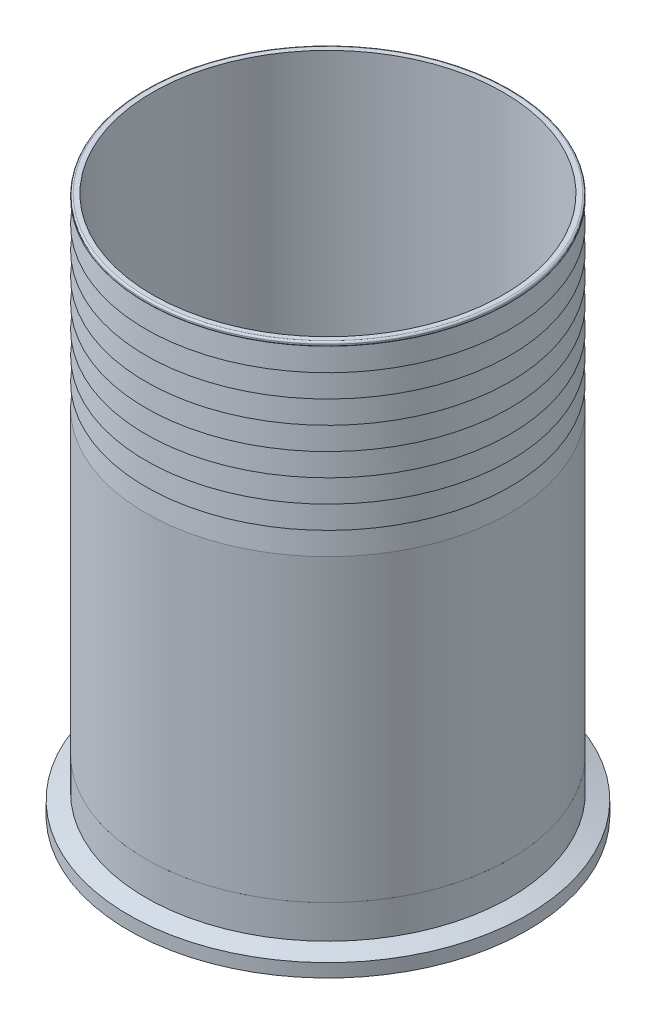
ISO-10303-21;
HEADER;
FILE_DESCRIPTION(('STEP AP214'),'2;1');
FILE_NAME('part.step','',(''),(''),'','','');
FILE_SCHEMA(('AUTOMOTIVE_DESIGN { 1 0 10303 214 1 1 1 1 }'));
ENDSEC;
DATA;
#1=APPLICATION_CONTEXT('core data for automotive mechanical design processes');
#2=APPLICATION_PROTOCOL_DEFINITION('international standard','automotive_design',2000,#1);
#3=PRODUCT_CONTEXT('',#1,'mechanical');
#4=PRODUCT('Part','Part','',(#3));
#5=PRODUCT_RELATED_PRODUCT_CATEGORY('part','',(#4));
#6=PRODUCT_DEFINITION_FORMATION('','',#4);
#7=PRODUCT_DEFINITION_CONTEXT('part definition',#1,'design');
#8=PRODUCT_DEFINITION('design','',#6,#7);
#9=PRODUCT_DEFINITION_SHAPE('','',#8);
#10=(LENGTH_UNIT() NAMED_UNIT(*) SI_UNIT(.MILLI.,.METRE.));
#11=(NAMED_UNIT(*) PLANE_ANGLE_UNIT() SI_UNIT($,.RADIAN.));
#12=(NAMED_UNIT(*) SI_UNIT($,.STERADIAN.) SOLID_ANGLE_UNIT());
#13=UNCERTAINTY_MEASURE_WITH_UNIT(LENGTH_MEASURE(1.E-05),#10,'distance_accuracy_value','');
#14=(GEOMETRIC_REPRESENTATION_CONTEXT(3) GLOBAL_UNCERTAINTY_ASSIGNED_CONTEXT((#13)) GLOBAL_UNIT_ASSIGNED_CONTEXT((#10,
#11,#12)) REPRESENTATION_CONTEXT('',''));
#15=CARTESIAN_POINT('',(0.,0.,0.));
#16=DIRECTION('',(0.,0.,1.));
#17=DIRECTION('',(1.,0.,0.));
#18=AXIS2_PLACEMENT_3D('',#15,#16,#17);
#19=CARTESIAN_POINT('',(37.7924001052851,92.9096416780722,208.508285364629));
#20=DIRECTION('',(0.,-1.,0.));
#21=DIRECTION('',(-0.363880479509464,0.,0.931445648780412));
#22=AXIS2_PLACEMENT_3D('',#19,#20,#21);
#23=PLANE('',#22);
#24=CARTESIAN_POINT('',(65.5200926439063,92.9096416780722,137.532126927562));
#25=DIRECTION('',(0.,-1.,0.));
#26=DIRECTION('',(0.931445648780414,0.,0.363880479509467));
#27=AXIS2_PLACEMENT_3D('',#24,#25,#26);
#28=CIRCLE('',#27,73.4314);
#29=CARTESIAN_POINT('',(133.91745065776,92.9096416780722,164.252379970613));
#30=VERTEX_POINT('',#29);
#31=EDGE_CURVE('P0_E85',#30,#30,#28,.T.);
#32=ORIENTED_EDGE('',*,*,#31,.F.);
#33=EDGE_LOOP('',(#32));
#34=FACE_BOUND('',#33,.T.);
#35=CARTESIAN_POINT('',(65.5200926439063,92.9096416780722,137.532126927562));
#36=DIRECTION('',(0.,-1.,0.));
#37=DIRECTION('',(-0.363880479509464,0.,0.931445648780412));
#38=AXIS2_PLACEMENT_3D('',#35,#36,#37);
#39=CIRCLE('',#38,76.2);
#40=CARTESIAN_POINT('',(37.7924001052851,92.9096416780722,208.508285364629));
#41=VERTEX_POINT('',#40);
#42=EDGE_CURVE('P0_E9',#41,#41,#39,.T.);
#43=ORIENTED_EDGE('',*,*,#42,.T.);
#44=EDGE_LOOP('',(#43));
#45=FACE_BOUND('',#44,.T.);
#46=ADVANCED_FACE('P0_F14',(#34,#45),#23,.T.);
#47=CARTESIAN_POINT('',(65.5200926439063,92.9096416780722,137.532126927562));
#48=DIRECTION('',(0.,-1.,0.));
#49=DIRECTION('',(-0.363880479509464,0.,0.931445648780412));
#50=AXIS2_PLACEMENT_3D('',#47,#48,#49);
#51=CYLINDRICAL_SURFACE('',#50,76.2);
#52=CARTESIAN_POINT('',(65.5200926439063,218.334841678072,137.532126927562));
#53=DIRECTION('',(0.,-1.,0.));
#54=DIRECTION('',(-0.363880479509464,0.,0.931445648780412));
#55=AXIS2_PLACEMENT_3D('',#52,#53,#54);
#56=CIRCLE('',#55,76.2);
#57=CARTESIAN_POINT('',(37.7924001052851,218.334841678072,208.508285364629));
#58=VERTEX_POINT('',#57);
#59=EDGE_CURVE('P0_E20',#58,#58,#56,.T.);
#60=ORIENTED_EDGE('',*,*,#59,.T.);
#61=EDGE_LOOP('',(#60));
#62=FACE_BOUND('',#61,.T.);
#63=ORIENTED_EDGE('',*,*,#42,.F.);
#64=EDGE_LOOP('',(#63));
#65=FACE_BOUND('',#64,.T.);
#66=ADVANCED_FACE('P0_F101',(#62,#65),#51,.T.);
#67=CARTESIAN_POINT('',(65.5200926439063,218.334841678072,137.532126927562));
#68=DIRECTION('',(0.,-1.,0.));
#69=DIRECTION('',(-0.363880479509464,0.,0.931445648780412));
#70=AXIS2_PLACEMENT_3D('',#67,#68,#69);
#71=CONICAL_SURFACE('',#70,76.2,0.0835411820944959);
#72=CARTESIAN_POINT('',(65.5200926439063,227.73819627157,137.532126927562));
#73=DIRECTION('',(0.,-1.,0.));
#74=DIRECTION('',(-0.363880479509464,0.,0.931445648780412));
#75=AXIS2_PLACEMENT_3D('',#72,#73,#74);
#76=CIRCLE('',#75,75.4126);
#77=CARTESIAN_POINT('',(38.0789195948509,227.73819627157,207.77486506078));
#78=VERTEX_POINT('',#77);
#79=EDGE_CURVE('P0_E24',#78,#78,#76,.T.);
#80=ORIENTED_EDGE('',*,*,#79,.T.);
#81=EDGE_LOOP('',(#80));
#82=FACE_BOUND('',#81,.T.);
#83=ORIENTED_EDGE('',*,*,#59,.F.);
#84=EDGE_LOOP('',(#83));
#85=FACE_BOUND('',#84,.T.);
#86=ADVANCED_FACE('P0_F106',(#82,#85),#71,.T.);
#87=CARTESIAN_POINT('',(65.5200926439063,227.73819627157,137.532126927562));
#88=DIRECTION('',(0.,1.,0.));
#89=DIRECTION('',(0.363880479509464,0.,-0.931445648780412));
#90=AXIS2_PLACEMENT_3D('',#87,#88,#89);
#91=CONICAL_SURFACE('',#90,75.4126,1.41751812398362);
#92=CARTESIAN_POINT('',(65.5200926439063,227.859841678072,137.532126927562));
#93=DIRECTION('',(0.,-1.,0.));
#94=DIRECTION('',(-0.363880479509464,0.,0.931445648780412));
#95=AXIS2_PLACEMENT_3D('',#92,#93,#94);
#96=CIRCLE('',#95,76.2);
#97=CARTESIAN_POINT('',(37.7924001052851,227.859841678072,208.508285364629));
#98=VERTEX_POINT('',#97);
#99=EDGE_CURVE('P0_E28',#98,#98,#96,.T.);
#100=ORIENTED_EDGE('',*,*,#99,.T.);
#101=EDGE_LOOP('',(#100));
#102=FACE_BOUND('',#101,.T.);
#103=ORIENTED_EDGE('',*,*,#79,.F.);
#104=EDGE_LOOP('',(#103));
#105=FACE_BOUND('',#104,.T.);
#106=ADVANCED_FACE('P0_F110',(#102,#105),#91,.T.);
#107=CARTESIAN_POINT('',(65.5200926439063,227.859841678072,137.532126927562));
#108=DIRECTION('',(0.,-1.,0.));
#109=DIRECTION('',(-0.363880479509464,0.,0.931445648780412));
#110=AXIS2_PLACEMENT_3D('',#107,#108,#109);
#111=CONICAL_SURFACE('',#110,76.2,0.0835411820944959);
#112=CARTESIAN_POINT('',(65.5200926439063,237.26319627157,137.532126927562));
#113=DIRECTION('',(0.,-1.,0.));
#114=DIRECTION('',(-0.363880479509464,0.,0.931445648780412));
#115=AXIS2_PLACEMENT_3D('',#112,#113,#114);
#116=CIRCLE('',#115,75.4126);
#117=CARTESIAN_POINT('',(38.0789195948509,237.26319627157,207.77486506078));
#118=VERTEX_POINT('',#117);
#119=EDGE_CURVE('P0_E33',#118,#118,#116,.T.);
#120=ORIENTED_EDGE('',*,*,#119,.T.);
#121=EDGE_LOOP('',(#120));
#122=FACE_BOUND('',#121,.T.);
#123=ORIENTED_EDGE('',*,*,#99,.F.);
#124=EDGE_LOOP('',(#123));
#125=FACE_BOUND('',#124,.T.);
#126=ADVANCED_FACE('P0_F117',(#122,#125),#111,.T.);
#127=CARTESIAN_POINT('',(65.5200926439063,237.26319627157,137.532126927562));
#128=DIRECTION('',(0.,1.,0.));
#129=DIRECTION('',(0.363880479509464,0.,-0.931445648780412));
#130=AXIS2_PLACEMENT_3D('',#127,#128,#129);
#131=CONICAL_SURFACE('',#130,75.4126,1.41751812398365);
#132=CARTESIAN_POINT('',(65.5200926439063,237.384841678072,137.532126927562));
#133=DIRECTION('',(0.,-1.,0.));
#134=DIRECTION('',(-0.363880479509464,0.,0.931445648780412));
#135=AXIS2_PLACEMENT_3D('',#132,#133,#134);
#136=CIRCLE('',#135,76.2);
#137=CARTESIAN_POINT('',(37.7924001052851,237.384841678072,208.508285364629));
#138=VERTEX_POINT('',#137);
#139=EDGE_CURVE('P0_E36',#138,#138,#136,.T.);
#140=ORIENTED_EDGE('',*,*,#139,.T.);
#141=EDGE_LOOP('',(#140));
#142=FACE_BOUND('',#141,.T.);
#143=ORIENTED_EDGE('',*,*,#119,.F.);
#144=EDGE_LOOP('',(#143));
#145=FACE_BOUND('',#144,.T.);
#146=ADVANCED_FACE('P0_F121',(#142,#145),#131,.T.);
#147=CARTESIAN_POINT('',(65.5200926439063,237.384841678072,137.532126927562));
#148=DIRECTION('',(0.,-1.,0.));
#149=DIRECTION('',(-0.363880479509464,0.,0.931445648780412));
#150=AXIS2_PLACEMENT_3D('',#147,#148,#149);
#151=CONICAL_SURFACE('',#150,76.2,0.0835411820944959);
#152=CARTESIAN_POINT('',(65.5200926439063,246.78819627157,137.532126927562));
#153=DIRECTION('',(0.,-1.,0.));
#154=DIRECTION('',(-0.363880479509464,0.,0.931445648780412));
#155=AXIS2_PLACEMENT_3D('',#152,#153,#154);
#156=CIRCLE('',#155,75.4126);
#157=CARTESIAN_POINT('',(38.0789195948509,246.78819627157,207.77486506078));
#158=VERTEX_POINT('',#157);
#159=EDGE_CURVE('P0_E39',#158,#158,#156,.T.);
#160=ORIENTED_EDGE('',*,*,#159,.T.);
#161=EDGE_LOOP('',(#160));
#162=FACE_BOUND('',#161,.T.);
#163=ORIENTED_EDGE('',*,*,#139,.F.);
#164=EDGE_LOOP('',(#163));
#165=FACE_BOUND('',#164,.T.);
#166=ADVANCED_FACE('P0_F125',(#162,#165),#151,.T.);
#167=CARTESIAN_POINT('',(65.5200926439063,246.78819627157,137.532126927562));
#168=DIRECTION('',(0.,1.,0.));
#169=DIRECTION('',(0.363880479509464,0.,-0.931445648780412));
#170=AXIS2_PLACEMENT_3D('',#167,#168,#169);
#171=CONICAL_SURFACE('',#170,75.4126,1.41751812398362);
#172=CARTESIAN_POINT('',(65.5200926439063,246.909841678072,137.532126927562));
#173=DIRECTION('',(0.,-1.,0.));
#174=DIRECTION('',(-0.363880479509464,0.,0.931445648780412));
#175=AXIS2_PLACEMENT_3D('',#172,#173,#174);
#176=CIRCLE('',#175,76.2);
#177=CARTESIAN_POINT('',(37.7924001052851,246.909841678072,208.508285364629));
#178=VERTEX_POINT('',#177);
#179=EDGE_CURVE('P0_E42',#178,#178,#176,.T.);
#180=ORIENTED_EDGE('',*,*,#179,.T.);
#181=EDGE_LOOP('',(#180));
#182=FACE_BOUND('',#181,.T.);
#183=ORIENTED_EDGE('',*,*,#159,.F.);
#184=EDGE_LOOP('',(#183));
#185=FACE_BOUND('',#184,.T.);
#186=ADVANCED_FACE('P0_F129',(#182,#185),#171,.T.);
#187=CARTESIAN_POINT('',(65.5200926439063,246.909841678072,137.532126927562));
#188=DIRECTION('',(0.,-1.,0.));
#189=DIRECTION('',(-0.363880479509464,0.,0.931445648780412));
#190=AXIS2_PLACEMENT_3D('',#187,#188,#189);
#191=CONICAL_SURFACE('',#190,76.2,0.0835411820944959);
#192=CARTESIAN_POINT('',(65.5200926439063,256.31319627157,137.532126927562));
#193=DIRECTION('',(0.,-1.,0.));
#194=DIRECTION('',(-0.363880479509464,0.,0.931445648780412));
#195=AXIS2_PLACEMENT_3D('',#192,#193,#194);
#196=CIRCLE('',#195,75.4126);
#197=CARTESIAN_POINT('',(38.0789195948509,256.31319627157,207.77486506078));
#198=VERTEX_POINT('',#197);
#199=EDGE_CURVE('P0_E45',#198,#198,#196,.T.);
#200=ORIENTED_EDGE('',*,*,#199,.T.);
#201=EDGE_LOOP('',(#200));
#202=FACE_BOUND('',#201,.T.);
#203=ORIENTED_EDGE('',*,*,#179,.F.);
#204=EDGE_LOOP('',(#203));
#205=FACE_BOUND('',#204,.T.);
#206=ADVANCED_FACE('P0_F133',(#202,#205),#191,.T.);
#207=CARTESIAN_POINT('',(65.5200926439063,256.31319627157,137.532126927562));
#208=DIRECTION('',(0.,1.,0.));
#209=DIRECTION('',(0.363880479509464,0.,-0.931445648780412));
#210=AXIS2_PLACEMENT_3D('',#207,#208,#209);
#211=CONICAL_SURFACE('',#210,75.4126,1.41751812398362);
#212=CARTESIAN_POINT('',(65.5200926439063,256.434841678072,137.532126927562));
#213=DIRECTION('',(0.,-1.,0.));
#214=DIRECTION('',(-0.363880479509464,0.,0.931445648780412));
#215=AXIS2_PLACEMENT_3D('',#212,#213,#214);
#216=CIRCLE('',#215,76.2);
#217=CARTESIAN_POINT('',(37.7924001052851,256.434841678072,208.508285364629));
#218=VERTEX_POINT('',#217);
#219=EDGE_CURVE('P0_E48',#218,#218,#216,.T.);
#220=ORIENTED_EDGE('',*,*,#219,.T.);
#221=EDGE_LOOP('',(#220));
#222=FACE_BOUND('',#221,.T.);
#223=ORIENTED_EDGE('',*,*,#199,.F.);
#224=EDGE_LOOP('',(#223));
#225=FACE_BOUND('',#224,.T.);
#226=ADVANCED_FACE('P0_F137',(#222,#225),#211,.T.);
#227=CARTESIAN_POINT('',(65.5200926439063,256.434841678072,137.532126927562));
#228=DIRECTION('',(0.,-1.,0.));
#229=DIRECTION('',(-0.363880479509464,0.,0.931445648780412));
#230=AXIS2_PLACEMENT_3D('',#227,#228,#229);
#231=CONICAL_SURFACE('',#230,76.2,0.0835411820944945);
#232=CARTESIAN_POINT('',(65.5200926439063,265.83819627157,137.532126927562));
#233=DIRECTION('',(0.,-1.,0.));
#234=DIRECTION('',(-0.363880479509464,0.,0.931445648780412));
#235=AXIS2_PLACEMENT_3D('',#232,#233,#234);
#236=CIRCLE('',#235,75.4126);
#237=CARTESIAN_POINT('',(38.0789195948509,265.83819627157,207.77486506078));
#238=VERTEX_POINT('',#237);
#239=EDGE_CURVE('P0_E51',#238,#238,#236,.T.);
#240=ORIENTED_EDGE('',*,*,#239,.T.);
#241=EDGE_LOOP('',(#240));
#242=FACE_BOUND('',#241,.T.);
#243=ORIENTED_EDGE('',*,*,#219,.F.);
#244=EDGE_LOOP('',(#243));
#245=FACE_BOUND('',#244,.T.);
#246=ADVANCED_FACE('P0_F141',(#242,#245),#231,.T.);
#247=CARTESIAN_POINT('',(65.5200926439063,265.83819627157,137.532126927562));
#248=DIRECTION('',(0.,1.,0.));
#249=DIRECTION('',(0.363880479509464,0.,-0.931445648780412));
#250=AXIS2_PLACEMENT_3D('',#247,#248,#249);
#251=CONICAL_SURFACE('',#250,75.4126,1.41751812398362);
#252=CARTESIAN_POINT('',(65.5200926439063,265.959841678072,137.532126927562));
#253=DIRECTION('',(0.,-1.,0.));
#254=DIRECTION('',(-0.363880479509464,0.,0.931445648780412));
#255=AXIS2_PLACEMENT_3D('',#252,#253,#254);
#256=CIRCLE('',#255,76.2);
#257=CARTESIAN_POINT('',(37.7924001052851,265.959841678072,208.508285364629));
#258=VERTEX_POINT('',#257);
#259=EDGE_CURVE('P0_E54',#258,#258,#256,.T.);
#260=ORIENTED_EDGE('',*,*,#259,.T.);
#261=EDGE_LOOP('',(#260));
#262=FACE_BOUND('',#261,.T.);
#263=ORIENTED_EDGE('',*,*,#239,.F.);
#264=EDGE_LOOP('',(#263));
#265=FACE_BOUND('',#264,.T.);
#266=ADVANCED_FACE('P0_F145',(#262,#265),#251,.T.);
#267=CARTESIAN_POINT('',(65.5200926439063,265.959841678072,137.532126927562));
#268=DIRECTION('',(0.,-1.,0.));
#269=DIRECTION('',(-0.363880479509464,0.,0.931445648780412));
#270=AXIS2_PLACEMENT_3D('',#267,#268,#269);
#271=CONICAL_SURFACE('',#270,76.2,0.0835411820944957);
#272=CARTESIAN_POINT('',(65.5200926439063,275.36319627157,137.532126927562));
#273=DIRECTION('',(0.,-1.,0.));
#274=DIRECTION('',(-0.363880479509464,0.,0.931445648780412));
#275=AXIS2_PLACEMENT_3D('',#272,#273,#274);
#276=CIRCLE('',#275,75.4126);
#277=CARTESIAN_POINT('',(38.0789195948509,275.36319627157,207.77486506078));
#278=VERTEX_POINT('',#277);
#279=EDGE_CURVE('P0_E57',#278,#278,#276,.T.);
#280=ORIENTED_EDGE('',*,*,#279,.T.);
#281=EDGE_LOOP('',(#280));
#282=FACE_BOUND('',#281,.T.);
#283=ORIENTED_EDGE('',*,*,#259,.F.);
#284=EDGE_LOOP('',(#283));
#285=FACE_BOUND('',#284,.T.);
#286=ADVANCED_FACE('P0_F149',(#282,#285),#271,.T.);
#287=CARTESIAN_POINT('',(65.5200926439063,275.36319627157,137.532126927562));
#288=DIRECTION('',(0.,1.,0.));
#289=DIRECTION('',(0.363880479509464,0.,-0.931445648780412));
#290=AXIS2_PLACEMENT_3D('',#287,#288,#289);
#291=CONICAL_SURFACE('',#290,75.4126,1.41751812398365);
#292=CARTESIAN_POINT('',(65.5200926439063,275.484841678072,137.532126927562));
#293=DIRECTION('',(0.,-1.,0.));
#294=DIRECTION('',(-0.363880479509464,0.,0.931445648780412));
#295=AXIS2_PLACEMENT_3D('',#292,#293,#294);
#296=CIRCLE('',#295,76.2);
#297=CARTESIAN_POINT('',(37.7924001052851,275.484841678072,208.508285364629));
#298=VERTEX_POINT('',#297);
#299=EDGE_CURVE('P0_E60',#298,#298,#296,.T.);
#300=ORIENTED_EDGE('',*,*,#299,.T.);
#301=EDGE_LOOP('',(#300));
#302=FACE_BOUND('',#301,.T.);
#303=ORIENTED_EDGE('',*,*,#279,.F.);
#304=EDGE_LOOP('',(#303));
#305=FACE_BOUND('',#304,.T.);
#306=ADVANCED_FACE('P0_F153',(#302,#305),#291,.T.);
#307=CARTESIAN_POINT('',(65.5200926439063,275.484841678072,137.532126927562));
#308=DIRECTION('',(0.,-1.,0.));
#309=DIRECTION('',(-0.363880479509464,0.,0.931445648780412));
#310=AXIS2_PLACEMENT_3D('',#307,#308,#309);
#311=CONICAL_SURFACE('',#310,76.2,0.0835411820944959);
#312=CARTESIAN_POINT('',(65.5200926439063,284.88819627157,137.532126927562));
#313=DIRECTION('',(0.,-1.,0.));
#314=DIRECTION('',(-0.363880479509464,0.,0.931445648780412));
#315=AXIS2_PLACEMENT_3D('',#312,#313,#314);
#316=CIRCLE('',#315,75.4126);
#317=CARTESIAN_POINT('',(38.0789195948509,284.88819627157,207.77486506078));
#318=VERTEX_POINT('',#317);
#319=EDGE_CURVE('P0_E63',#318,#318,#316,.T.);
#320=ORIENTED_EDGE('',*,*,#319,.T.);
#321=EDGE_LOOP('',(#320));
#322=FACE_BOUND('',#321,.T.);
#323=ORIENTED_EDGE('',*,*,#299,.F.);
#324=EDGE_LOOP('',(#323));
#325=FACE_BOUND('',#324,.T.);
#326=ADVANCED_FACE('P0_F157',(#322,#325),#311,.T.);
#327=CARTESIAN_POINT('',(65.5200926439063,284.88819627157,137.532126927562));
#328=DIRECTION('',(0.,1.,0.));
#329=DIRECTION('',(0.363880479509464,0.,-0.931445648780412));
#330=AXIS2_PLACEMENT_3D('',#327,#328,#329);
#331=CONICAL_SURFACE('',#330,75.4126,1.41751812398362);
#332=CARTESIAN_POINT('',(65.5200926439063,285.009841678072,137.532126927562));
#333=DIRECTION('',(0.,-1.,0.));
#334=DIRECTION('',(-0.363880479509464,0.,0.931445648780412));
#335=AXIS2_PLACEMENT_3D('',#332,#333,#334);
#336=CIRCLE('',#335,76.2);
#337=CARTESIAN_POINT('',(37.7924001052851,285.009841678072,208.508285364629));
#338=VERTEX_POINT('',#337);
#339=EDGE_CURVE('P0_E66',#338,#338,#336,.T.);
#340=ORIENTED_EDGE('',*,*,#339,.T.);
#341=EDGE_LOOP('',(#340));
#342=FACE_BOUND('',#341,.T.);
#343=ORIENTED_EDGE('',*,*,#319,.F.);
#344=EDGE_LOOP('',(#343));
#345=FACE_BOUND('',#344,.T.);
#346=ADVANCED_FACE('P0_F161',(#342,#345),#331,.T.);
#347=CARTESIAN_POINT('',(65.5200926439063,285.009841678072,137.532126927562));
#348=DIRECTION('',(0.,-1.,0.));
#349=DIRECTION('',(-0.363880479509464,0.,0.931445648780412));
#350=AXIS2_PLACEMENT_3D('',#347,#348,#349);
#351=CONICAL_SURFACE('',#350,76.2,0.0835411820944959);
#352=CARTESIAN_POINT('',(65.5200926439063,294.41319627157,137.532126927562));
#353=DIRECTION('',(0.,-1.,0.));
#354=DIRECTION('',(-0.363880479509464,0.,0.931445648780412));
#355=AXIS2_PLACEMENT_3D('',#352,#353,#354);
#356=CIRCLE('',#355,75.4126);
#357=CARTESIAN_POINT('',(38.0789195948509,294.41319627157,207.77486506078));
#358=VERTEX_POINT('',#357);
#359=EDGE_CURVE('P0_E69',#358,#358,#356,.T.);
#360=ORIENTED_EDGE('',*,*,#359,.T.);
#361=EDGE_LOOP('',(#360));
#362=FACE_BOUND('',#361,.T.);
#363=ORIENTED_EDGE('',*,*,#339,.F.);
#364=EDGE_LOOP('',(#363));
#365=FACE_BOUND('',#364,.T.);
#366=ADVANCED_FACE('P0_F165',(#362,#365),#351,.T.);
#367=CARTESIAN_POINT('',(65.5200926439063,294.41319627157,137.532126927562));
#368=DIRECTION('',(0.,1.,0.));
#369=DIRECTION('',(0.363880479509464,0.,-0.931445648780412));
#370=AXIS2_PLACEMENT_3D('',#367,#368,#369);
#371=CONICAL_SURFACE('',#370,75.4126,1.41751812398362);
#372=CARTESIAN_POINT('',(65.5200926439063,294.501592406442,137.532126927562));
#373=DIRECTION('',(0.,-1.,0.));
#374=DIRECTION('',(-0.363880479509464,0.,0.931445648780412));
#375=AXIS2_PLACEMENT_3D('',#372,#373,#374);
#376=CIRCLE('',#375,75.9847803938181);
#377=CARTESIAN_POINT('',(37.8707143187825,294.501592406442,208.307819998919));
#378=VERTEX_POINT('',#377);
#379=EDGE_CURVE('P0_E72',#378,#378,#376,.T.);
#380=ORIENTED_EDGE('',*,*,#379,.T.);
#381=EDGE_LOOP('',(#380));
#382=FACE_BOUND('',#381,.T.);
#383=ORIENTED_EDGE('',*,*,#359,.F.);
#384=EDGE_LOOP('',(#383));
#385=FACE_BOUND('',#384,.T.);
#386=ADVANCED_FACE('P0_F169',(#382,#385),#371,.T.);
#387=CARTESIAN_POINT('',(65.5200926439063,294.752614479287,137.532126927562));
#388=DIRECTION('',(0.,-1.,0.));
#389=DIRECTION('',(-0.363880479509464,0.,0.931445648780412));
#390=AXIS2_PLACEMENT_3D('',#387,#388,#389);
#391=TOROIDAL_SURFACE('',#390,75.946,0.254000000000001);
#392=CARTESIAN_POINT('',(65.5200926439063,294.752614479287,137.532126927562));
#393=DIRECTION('',(0.,-1.,0.));
#394=DIRECTION('',(-0.363880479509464,0.,0.931445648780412));
#395=AXIS2_PLACEMENT_3D('',#392,#393,#394);
#396=CIRCLE('',#395,76.2);
#397=CARTESIAN_POINT('',(37.7924001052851,294.752614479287,208.508285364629));
#398=VERTEX_POINT('',#397);
#399=EDGE_CURVE('P0_E75',#398,#398,#396,.T.);
#400=ORIENTED_EDGE('',*,*,#399,.T.);
#401=EDGE_LOOP('',(#400));
#402=FACE_BOUND('',#401,.T.);
#403=ORIENTED_EDGE('',*,*,#379,.F.);
#404=EDGE_LOOP('',(#403));
#405=FACE_BOUND('',#404,.T.);
#406=ADVANCED_FACE('P0_F173',(#402,#405),#391,.T.);
#407=CARTESIAN_POINT('',(65.5200926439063,92.9096416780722,137.532126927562));
#408=DIRECTION('',(0.,-1.,0.));
#409=DIRECTION('',(-0.363880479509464,0.,0.931445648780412));
#410=AXIS2_PLACEMENT_3D('',#407,#408,#409);
#411=CYLINDRICAL_SURFACE('',#410,76.2);
#412=CARTESIAN_POINT('',(65.5200926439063,295.347641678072,137.532126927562));
#413=DIRECTION('',(0.,-1.,0.));
#414=DIRECTION('',(-0.363880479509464,0.,0.931445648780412));
#415=AXIS2_PLACEMENT_3D('',#412,#413,#414);
#416=CIRCLE('',#415,76.2);
#417=CARTESIAN_POINT('',(37.7924001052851,295.347641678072,208.508285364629));
#418=VERTEX_POINT('',#417);
#419=EDGE_CURVE('P0_E78',#418,#418,#416,.T.);
#420=ORIENTED_EDGE('',*,*,#419,.T.);
#421=EDGE_LOOP('',(#420));
#422=FACE_BOUND('',#421,.T.);
#423=ORIENTED_EDGE('',*,*,#399,.F.);
#424=EDGE_LOOP('',(#423));
#425=FACE_BOUND('',#424,.T.);
#426=ADVANCED_FACE('P0_F177',(#422,#425),#411,.T.);
#427=CARTESIAN_POINT('',(65.5200926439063,295.347641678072,137.532126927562));
#428=DIRECTION('',(0.,-1.,0.));
#429=DIRECTION('',(-0.363880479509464,0.,0.931445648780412));
#430=AXIS2_PLACEMENT_3D('',#427,#428,#429);
#431=TOROIDAL_SURFACE('',#430,75.438,0.76200000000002);
#432=CARTESIAN_POINT('',(65.5200926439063,296.109641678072,137.532126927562));
#433=DIRECTION('',(0.,-1.,0.));
#434=DIRECTION('',(-0.363880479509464,0.,0.931445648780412));
#435=AXIS2_PLACEMENT_3D('',#432,#433,#434);
#436=CIRCLE('',#435,75.4379999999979);
#437=CARTESIAN_POINT('',(38.0696770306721,296.109641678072,207.798523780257));
#438=VERTEX_POINT('',#437);
#439=EDGE_CURVE('P0_E81',#438,#438,#436,.T.);
#440=ORIENTED_EDGE('',*,*,#439,.T.);
#441=EDGE_LOOP('',(#440));
#442=FACE_BOUND('',#441,.T.);
#443=ORIENTED_EDGE('',*,*,#419,.F.);
#444=EDGE_LOOP('',(#443));
#445=FACE_BOUND('',#444,.T.);
#446=ADVANCED_FACE('P0_F181',(#442,#445),#431,.T.);
#447=CARTESIAN_POINT('',(65.5200926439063,296.109641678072,137.532126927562));
#448=DIRECTION('',(0.,1.,0.));
#449=DIRECTION('',(0.363880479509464,0.,-0.931445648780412));
#450=AXIS2_PLACEMENT_3D('',#447,#448,#449);
#451=PLANE('',#450);
#452=CARTESIAN_POINT('',(65.5200926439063,296.109641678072,137.532126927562));
#453=DIRECTION('',(0.,-1.,0.));
#454=DIRECTION('',(0.931445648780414,0.,0.363880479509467));
#455=AXIS2_PLACEMENT_3D('',#452,#453,#454);
#456=CIRCLE('',#455,73.4314);
#457=CARTESIAN_POINT('',(133.91745065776,296.109641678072,164.252379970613));
#458=VERTEX_POINT('',#457);
#459=EDGE_CURVE('P0_E84',#458,#458,#456,.T.);
#460=ORIENTED_EDGE('',*,*,#459,.T.);
#461=EDGE_LOOP('',(#460));
#462=FACE_BOUND('',#461,.T.);
#463=ORIENTED_EDGE('',*,*,#439,.F.);
#464=EDGE_LOOP('',(#463));
#465=FACE_BOUND('',#464,.T.);
#466=ADVANCED_FACE('P0_F91',(#462,#465),#451,.T.);
#467=CARTESIAN_POINT('',(65.5200926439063,296.109641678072,137.532126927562));
#468=DIRECTION('',(0.,-1.,0.));
#469=DIRECTION('',(0.931445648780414,0.,0.363880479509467));
#470=AXIS2_PLACEMENT_3D('',#467,#468,#469);
#471=CYLINDRICAL_SURFACE('',#470,73.4314);
#472=ORIENTED_EDGE('',*,*,#459,.F.);
#473=EDGE_LOOP('',(#472));
#474=FACE_BOUND('',#473,.T.);
#475=ORIENTED_EDGE('',*,*,#31,.T.);
#476=EDGE_LOOP('',(#475));
#477=FACE_BOUND('',#476,.T.);
#478=ADVANCED_FACE('P0_F94',(#474,#477),#471,.F.);
#479=CLOSED_SHELL('',(#46,#66,#86,#106,#126,#146,#166,#186,#206,#226,#246,#266,#286,#306,#326,
#346,#366,#386,#406,#426,#446,#466,#478));
#480=MANIFOLD_SOLID_BREP('P0_B1',#479);
#481=CARTESIAN_POINT('',(65.5200926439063,71.4720416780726,137.532126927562));
#482=DIRECTION('',(0.,-0.999999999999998,0.));
#483=DIRECTION('',(0.,0.,-0.999999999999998));
#484=AXIS2_PLACEMENT_3D('',#481,#482,#483);
#485=TOROIDAL_SURFACE('',#484,79.9992084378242,0.787400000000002);
#486=CARTESIAN_POINT('',(65.5200926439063,70.6846416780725,137.532126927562));
#487=DIRECTION('',(0.,-0.999999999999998,0.));
#488=DIRECTION('',(0.,0.,-0.999999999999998));
#489=AXIS2_PLACEMENT_3D('',#486,#487,#488);
#490=CIRCLE('',#489,79.9992084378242);
#491=CARTESIAN_POINT('',(65.5200926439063,70.6846416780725,57.5329184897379));
#492=VERTEX_POINT('',#491);
#493=EDGE_CURVE('P1_E49',#492,#492,#490,.T.);
#494=ORIENTED_EDGE('',*,*,#493,.T.);
#495=EDGE_LOOP('',(#494));
#496=FACE_BOUND('',#495,.T.);
#497=CARTESIAN_POINT('',(65.5200926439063,71.1591006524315,137.532126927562));
#498=DIRECTION('',(0.,-0.999999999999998,0.));
#499=DIRECTION('',(0.,0.,-0.999999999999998));
#500=AXIS2_PLACEMENT_3D('',#497,#498,#499);
#501=CIRCLE('',#500,79.2766666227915);
#502=CARTESIAN_POINT('',(65.5200926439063,71.1591006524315,58.2554603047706));
#503=VERTEX_POINT('',#502);
#504=EDGE_CURVE('P1_E10',#503,#503,#501,.T.);
#505=ORIENTED_EDGE('',*,*,#504,.F.);
#506=EDGE_LOOP('',(#505));
#507=FACE_BOUND('',#506,.T.);
#508=ADVANCED_FACE('P1_F15',(#496,#507),#485,.T.);
#509=CARTESIAN_POINT('',(65.5200926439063,70.6846416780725,137.532126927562));
#510=DIRECTION('',(0.,-0.999999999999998,0.));
#511=DIRECTION('',(0.,0.,-0.999999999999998));
#512=AXIS2_PLACEMENT_3D('',#509,#510,#511);
#513=TOROIDAL_SURFACE('',#512,78.1812,1.1938);
#514=CARTESIAN_POINT('',(65.5200926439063,71.1591006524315,137.532126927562));
#515=DIRECTION('',(0.,-0.999999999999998,0.));
#516=DIRECTION('',(0.,0.,-0.999999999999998));
#517=AXIS2_PLACEMENT_3D('',#514,#515,#516);
#518=CIRCLE('',#517,77.0857333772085);
#519=CARTESIAN_POINT('',(65.5200926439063,71.1591006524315,60.4463935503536));
#520=VERTEX_POINT('',#519);
#521=EDGE_CURVE('P1_E21',#520,#520,#518,.T.);
#522=ORIENTED_EDGE('',*,*,#521,.F.);
#523=EDGE_LOOP('',(#522));
#524=FACE_BOUND('',#523,.T.);
#525=ORIENTED_EDGE('',*,*,#504,.T.);
#526=EDGE_LOOP('',(#525));
#527=FACE_BOUND('',#526,.T.);
#528=ADVANCED_FACE('P1_F98',(#524,#527),#513,.F.);
#529=CARTESIAN_POINT('',(65.5200926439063,71.4720416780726,137.532126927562));
#530=DIRECTION('',(0.,-0.999999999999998,0.));
#531=DIRECTION('',(0.,0.,-0.999999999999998));
#532=AXIS2_PLACEMENT_3D('',#529,#530,#531);
#533=TOROIDAL_SURFACE('',#532,76.3631915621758,0.787399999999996);
#534=ORIENTED_EDGE('',*,*,#521,.T.);
#535=EDGE_LOOP('',(#534));
#536=FACE_BOUND('',#535,.T.);
#537=CARTESIAN_POINT('',(65.5200926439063,70.6846416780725,137.532126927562));
#538=DIRECTION('',(0.,-0.999999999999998,0.));
#539=DIRECTION('',(0.,0.,-0.999999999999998));
#540=AXIS2_PLACEMENT_3D('',#537,#538,#539);
#541=CIRCLE('',#540,76.3631915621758);
#542=CARTESIAN_POINT('',(65.5200926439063,70.6846416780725,61.1689353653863));
#543=VERTEX_POINT('',#542);
#544=EDGE_CURVE('P1_E25',#543,#543,#541,.T.);
#545=ORIENTED_EDGE('',*,*,#544,.F.);
#546=EDGE_LOOP('',(#545));
#547=FACE_BOUND('',#546,.T.);
#548=ADVANCED_FACE('P1_F94',(#536,#547),#533,.T.);
#549=CARTESIAN_POINT('',(65.5200926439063,70.6846416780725,137.532126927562));
#550=DIRECTION('',(0.,0.999999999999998,0.));
#551=DIRECTION('',(0.,0.,0.999999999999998));
#552=AXIS2_PLACEMENT_3D('',#549,#550,#551);
#553=PLANE('',#552);
#554=CARTESIAN_POINT('',(65.5200926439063,70.6846416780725,137.532126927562));
#555=DIRECTION('',(0.,-0.999999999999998,0.));
#556=DIRECTION('',(0.,0.,-0.999999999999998));
#557=AXIS2_PLACEMENT_3D('',#554,#555,#556);
#558=CIRCLE('',#557,73.4314);
#559=CARTESIAN_POINT('',(65.5200926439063,70.6846416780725,64.1007269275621));
#560=VERTEX_POINT('',#559);
#561=EDGE_CURVE('P1_E29',#560,#560,#558,.T.);
#562=ORIENTED_EDGE('',*,*,#561,.F.);
#563=EDGE_LOOP('',(#562));
#564=FACE_BOUND('',#563,.T.);
#565=ORIENTED_EDGE('',*,*,#544,.T.);
#566=EDGE_LOOP('',(#565));
#567=FACE_BOUND('',#566,.T.);
#568=ADVANCED_FACE('P1_F87',(#564,#567),#553,.F.);
#569=CARTESIAN_POINT('',(65.5200926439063,70.6846416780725,137.532126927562));
#570=DIRECTION('',(0.,-0.999999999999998,0.));
#571=DIRECTION('',(0.,0.,-0.999999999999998));
#572=AXIS2_PLACEMENT_3D('',#569,#570,#571);
#573=CYLINDRICAL_SURFACE('',#572,73.4314);
#574=CARTESIAN_POINT('',(65.5200926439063,92.9096416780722,137.532126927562));
#575=DIRECTION('',(0.,-0.999999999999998,0.));
#576=DIRECTION('',(0.,0.,-0.999999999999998));
#577=AXIS2_PLACEMENT_3D('',#574,#575,#576);
#578=CIRCLE('',#577,73.4314);
#579=CARTESIAN_POINT('',(65.5200926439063,92.9096416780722,64.1007269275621));
#580=VERTEX_POINT('',#579);
#581=EDGE_CURVE('P1_E34',#580,#580,#578,.T.);
#582=CARTESIAN_POINT('',(65.5200926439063,70.6846416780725,64.1007269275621));
#583=CARTESIAN_POINT('',(65.5200926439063,70.9161520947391,64.1007269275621));
#584=CARTESIAN_POINT('',(65.5200926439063,71.1476625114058,64.1007269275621));
#585=CARTESIAN_POINT('',(65.5200926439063,71.6106833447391,64.1007269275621));
#586=CARTESIAN_POINT('',(65.5200926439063,71.8421937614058,64.1007269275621));
#587=CARTESIAN_POINT('',(65.5200926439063,72.3052145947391,64.1007269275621));
#588=CARTESIAN_POINT('',(65.5200926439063,72.5367250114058,64.1007269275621));
#589=CARTESIAN_POINT('',(65.5200926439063,72.9997458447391,64.1007269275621));
#590=CARTESIAN_POINT('',(65.5200926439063,73.2312562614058,64.1007269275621));
#591=CARTESIAN_POINT('',(65.5200926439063,73.6942770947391,64.1007269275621));
#592=CARTESIAN_POINT('',(65.5200926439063,73.9257875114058,64.1007269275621));
#593=CARTESIAN_POINT('',(65.5200926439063,74.3888083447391,64.1007269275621));
#594=CARTESIAN_POINT('',(65.5200926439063,74.6203187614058,64.1007269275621));
#595=CARTESIAN_POINT('',(65.5200926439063,75.0833395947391,64.1007269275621));
#596=CARTESIAN_POINT('',(65.5200926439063,75.3148500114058,64.1007269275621));
#597=CARTESIAN_POINT('',(65.5200926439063,75.7778708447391,64.1007269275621));
#598=CARTESIAN_POINT('',(65.5200926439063,76.0093812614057,64.1007269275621));
#599=CARTESIAN_POINT('',(65.5200926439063,76.4724020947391,64.1007269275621));
#600=CARTESIAN_POINT('',(65.5200926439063,76.7039125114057,64.1007269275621));
#601=CARTESIAN_POINT('',(65.5200926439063,77.1669333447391,64.1007269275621));
#602=CARTESIAN_POINT('',(65.5200926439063,77.3984437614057,64.1007269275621));
#603=CARTESIAN_POINT('',(65.5200926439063,77.8614645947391,64.1007269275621));
#604=CARTESIAN_POINT('',(65.5200926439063,78.0929750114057,64.1007269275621));
#605=CARTESIAN_POINT('',(65.5200926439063,78.555995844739,64.1007269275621));
#606=CARTESIAN_POINT('',(65.5200926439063,78.7875062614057,64.1007269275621));
#607=CARTESIAN_POINT('',(65.5200926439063,79.250527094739,64.1007269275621));
#608=CARTESIAN_POINT('',(65.5200926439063,79.4820375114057,64.1007269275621));
#609=CARTESIAN_POINT('',(65.5200926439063,79.945058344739,64.1007269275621));
#610=CARTESIAN_POINT('',(65.5200926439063,80.1765687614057,64.1007269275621));
#611=CARTESIAN_POINT('',(65.5200926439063,80.639589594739,64.1007269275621));
#612=CARTESIAN_POINT('',(65.5200926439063,80.8711000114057,64.1007269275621));
#613=CARTESIAN_POINT('',(65.5200926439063,81.334120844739,64.1007269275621));
#614=CARTESIAN_POINT('',(65.5200926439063,81.5656312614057,64.1007269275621));
#615=CARTESIAN_POINT('',(65.5200926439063,82.028652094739,64.1007269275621));
#616=CARTESIAN_POINT('',(65.5200926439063,82.2601625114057,64.1007269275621));
#617=CARTESIAN_POINT('',(65.5200926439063,82.723183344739,64.1007269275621));
#618=CARTESIAN_POINT('',(65.5200926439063,82.9546937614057,64.1007269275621));
#619=CARTESIAN_POINT('',(65.5200926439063,83.417714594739,64.1007269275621));
#620=CARTESIAN_POINT('',(65.5200926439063,83.6492250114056,64.1007269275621));
#621=CARTESIAN_POINT('',(65.5200926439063,84.112245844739,64.1007269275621));
#622=CARTESIAN_POINT('',(65.5200926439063,84.3437562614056,64.1007269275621));
#623=CARTESIAN_POINT('',(65.5200926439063,84.806777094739,64.1007269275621));
#624=CARTESIAN_POINT('',(65.5200926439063,85.0382875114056,64.1007269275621));
#625=CARTESIAN_POINT('',(65.5200926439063,85.501308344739,64.1007269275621));
#626=CARTESIAN_POINT('',(65.5200926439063,85.7328187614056,64.1007269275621));
#627=CARTESIAN_POINT('',(65.5200926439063,86.1958395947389,64.1007269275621));
#628=CARTESIAN_POINT('',(65.5200926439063,86.4273500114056,64.1007269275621));
#629=CARTESIAN_POINT('',(65.5200926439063,86.8903708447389,64.1007269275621));
#630=CARTESIAN_POINT('',(65.5200926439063,87.1218812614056,64.1007269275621));
#631=CARTESIAN_POINT('',(65.5200926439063,87.5849020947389,64.1007269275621));
#632=CARTESIAN_POINT('',(65.5200926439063,87.8164125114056,64.1007269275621));
#633=CARTESIAN_POINT('',(65.5200926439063,88.2794333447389,64.1007269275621));
#634=CARTESIAN_POINT('',(65.5200926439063,88.5109437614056,64.1007269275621));
#635=CARTESIAN_POINT('',(65.5200926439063,88.9739645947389,64.1007269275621));
#636=CARTESIAN_POINT('',(65.5200926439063,89.2054750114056,64.1007269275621));
#637=CARTESIAN_POINT('',(65.5200926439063,89.6684958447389,64.1007269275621));
#638=CARTESIAN_POINT('',(65.5200926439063,89.9000062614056,64.1007269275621));
#639=CARTESIAN_POINT('',(65.5200926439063,90.3630270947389,64.1007269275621));
#640=CARTESIAN_POINT('',(65.5200926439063,90.5945375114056,64.1007269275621));
#641=CARTESIAN_POINT('',(65.5200926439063,91.0575583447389,64.1007269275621));
#642=CARTESIAN_POINT('',(65.5200926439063,91.2890687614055,64.1007269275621));
#643=CARTESIAN_POINT('',(65.5200926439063,91.7520895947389,64.1007269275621));
#644=CARTESIAN_POINT('',(65.5200926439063,91.9836000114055,64.1007269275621));
#645=CARTESIAN_POINT('',(65.5200926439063,92.4466208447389,64.1007269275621));
#646=CARTESIAN_POINT('',(65.5200926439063,92.6781312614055,64.1007269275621));
#647=CARTESIAN_POINT('',(65.5200926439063,92.9096416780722,64.1007269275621));
#648=B_SPLINE_CURVE_WITH_KNOTS('',3,(#582,#583,#584,#585,#586,#587,#588,#589,#590,#591,#592,
#593,#594,#595,#596,#597,#598,#599,#600,#601,#602,#603,#604,#605,#606,#607,#608,#609,#610,#611,
#612,#613,#614,#615,#616,#617,#618,#619,#620,#621,#622,#623,#624,#625,#626,#627,#628,#629,#630,
#631,#632,#633,#634,#635,#636,#637,#638,#639,#640,#641,#642,#643,#644,#645,#646,#647),
.UNSPECIFIED.,.F.,.F.,(4,2,2,2,2,2,2,2,2,2,2,2,2,2,2,2,2,2,2,2,2,2,2,2,2,2,2,2,2,2,2,2,4),(0.,
0.694531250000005,1.3890625,2.08359374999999,2.77812499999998,3.47265624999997,4.16718749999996,
4.86171874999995,5.55624999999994,6.25078124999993,6.94531249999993,7.63984374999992,
8.33437499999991,9.0289062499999,9.72343749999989,10.4179687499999,11.1124999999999,
11.8070312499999,12.5015624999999,13.1960937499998,13.8906249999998,14.5851562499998,
15.2796874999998,15.9742187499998,16.6687499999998,17.3632812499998,18.0578124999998,
18.7523437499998,19.4468749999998,20.1414062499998,20.8359374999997,21.5304687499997,
22.2249999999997),.UNSPECIFIED.);
#649=EDGE_CURVE('P1_BSEAM82',#560,#580,#648,.T.);
#650=ORIENTED_EDGE('',*,*,#561,.T.);
#651=ORIENTED_EDGE('',*,*,#581,.F.);
#652=ORIENTED_EDGE('',*,*,#649,.T.);
#653=ORIENTED_EDGE('',*,*,#649,.F.);
#654=EDGE_LOOP('',(#650,#652,#651,#653));
#655=FACE_BOUND('',#654,.T.);
#656=ADVANCED_FACE('P1_F82',(#655),#573,.F.);
#657=CARTESIAN_POINT('',(65.5200926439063,92.9096416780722,137.532126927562));
#658=DIRECTION('',(0.,-0.999999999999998,0.));
#659=DIRECTION('',(0.,0.,-0.999999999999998));
#660=AXIS2_PLACEMENT_3D('',#657,#658,#659);
#661=PLANE('',#660);
#662=CARTESIAN_POINT('',(65.5200926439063,92.9096416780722,137.532126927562));
#663=DIRECTION('',(0.,-0.999999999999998,0.));
#664=DIRECTION('',(0.,0.,-0.999999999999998));
#665=AXIS2_PLACEMENT_3D('',#662,#663,#664);
#666=CIRCLE('',#665,76.2);
#667=CARTESIAN_POINT('',(65.5200926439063,92.9096416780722,61.3321269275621));
#668=VERTEX_POINT('',#667);
#669=EDGE_CURVE('P1_E37',#668,#668,#666,.T.);
#670=ORIENTED_EDGE('',*,*,#669,.F.);
#671=EDGE_LOOP('',(#670));
#672=FACE_BOUND('',#671,.T.);
#673=ORIENTED_EDGE('',*,*,#581,.T.);
#674=EDGE_LOOP('',(#673));
#675=FACE_BOUND('',#674,.T.);
#676=ADVANCED_FACE('P1_F76',(#672,#675),#661,.F.);
#677=CARTESIAN_POINT('',(65.5200926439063,70.6846416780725,137.532126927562));
#678=DIRECTION('',(0.,-0.999999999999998,0.));
#679=DIRECTION('',(0.,0.,-0.999999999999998));
#680=AXIS2_PLACEMENT_3D('',#677,#678,#679);
#681=CYLINDRICAL_SURFACE('',#680,76.2);
#682=CARTESIAN_POINT('',(65.5200926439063,78.9074222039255,137.532126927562));
#683=DIRECTION('',(0.,-0.999999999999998,0.));
#684=DIRECTION('',(0.,0.,-0.999999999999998));
#685=AXIS2_PLACEMENT_3D('',#682,#683,#684);
#686=CIRCLE('',#685,76.2);
#687=CARTESIAN_POINT('',(65.5200926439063,78.9074222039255,61.3321269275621));
#688=VERTEX_POINT('',#687);
#689=EDGE_CURVE('P1_E40',#688,#688,#686,.T.);
#690=CARTESIAN_POINT('',(65.5200926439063,78.9074222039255,61.3321269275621));
#691=CARTESIAN_POINT('',(65.5200926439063,79.0532786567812,61.3321269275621));
#692=CARTESIAN_POINT('',(65.5200926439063,79.1991351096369,61.3321269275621));
#693=CARTESIAN_POINT('',(65.5200926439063,79.4908480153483,61.3321269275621));
#694=CARTESIAN_POINT('',(65.5200926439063,79.6367044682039,61.3321269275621));
#695=CARTESIAN_POINT('',(65.5200926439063,79.9284173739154,61.3321269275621));
#696=CARTESIAN_POINT('',(65.5200926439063,80.074273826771,61.3321269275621));
#697=CARTESIAN_POINT('',(65.5200926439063,80.3659867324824,61.3321269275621));
#698=CARTESIAN_POINT('',(65.5200926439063,80.5118431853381,61.3321269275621));
#699=CARTESIAN_POINT('',(65.5200926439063,80.8035560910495,61.3321269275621));
#700=CARTESIAN_POINT('',(65.5200926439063,80.9494125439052,61.3321269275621));
#701=CARTESIAN_POINT('',(65.5200926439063,81.2411254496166,61.3321269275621));
#702=CARTESIAN_POINT('',(65.5200926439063,81.3869819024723,61.3321269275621));
#703=CARTESIAN_POINT('',(65.5200926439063,81.6786948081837,61.3321269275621));
#704=CARTESIAN_POINT('',(65.5200926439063,81.8245512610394,61.3321269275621));
#705=CARTESIAN_POINT('',(65.5200926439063,82.1162641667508,61.3321269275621));
#706=CARTESIAN_POINT('',(65.5200926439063,82.2621206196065,61.3321269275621));
#707=CARTESIAN_POINT('',(65.5200926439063,82.5538335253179,61.3321269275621));
#708=CARTESIAN_POINT('',(65.5200926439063,82.6996899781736,61.3321269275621));
#709=CARTESIAN_POINT('',(65.5200926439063,82.9914028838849,61.3321269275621));
#710=CARTESIAN_POINT('',(65.5200926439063,83.1372593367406,61.3321269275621));
#711=CARTESIAN_POINT('',(65.5200926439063,83.428972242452,61.3321269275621));
#712=CARTESIAN_POINT('',(65.5200926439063,83.5748286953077,61.3321269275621));
#713=CARTESIAN_POINT('',(65.5200926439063,83.8665416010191,61.3321269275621));
#714=CARTESIAN_POINT('',(65.5200926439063,84.0123980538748,61.3321269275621));
#715=CARTESIAN_POINT('',(65.5200926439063,84.3041109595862,61.3321269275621));
#716=CARTESIAN_POINT('',(65.5200926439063,84.4499674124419,61.3321269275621));
#717=CARTESIAN_POINT('',(65.5200926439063,84.7416803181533,61.3321269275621));
#718=CARTESIAN_POINT('',(65.5200926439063,84.887536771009,61.3321269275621));
#719=CARTESIAN_POINT('',(65.5200926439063,85.1792496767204,61.3321269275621));
#720=CARTESIAN_POINT('',(65.5200926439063,85.3251061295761,61.3321269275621));
#721=CARTESIAN_POINT('',(65.5200926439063,85.6168190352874,61.3321269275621));
#722=CARTESIAN_POINT('',(65.5200926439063,85.7626754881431,61.3321269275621));
#723=CARTESIAN_POINT('',(65.5200926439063,86.0543883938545,61.3321269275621));
#724=CARTESIAN_POINT('',(65.5200926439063,86.2002448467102,61.3321269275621));
#725=CARTESIAN_POINT('',(65.5200926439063,86.4919577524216,61.3321269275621));
#726=CARTESIAN_POINT('',(65.5200926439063,86.6378142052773,61.3321269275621));
#727=CARTESIAN_POINT('',(65.5200926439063,86.9295271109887,61.3321269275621));
#728=CARTESIAN_POINT('',(65.5200926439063,87.0753835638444,61.3321269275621));
#729=CARTESIAN_POINT('',(65.5200926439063,87.3670964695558,61.3321269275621));
#730=CARTESIAN_POINT('',(65.5200926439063,87.5129529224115,61.3321269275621));
#731=CARTESIAN_POINT('',(65.5200926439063,87.8046658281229,61.3321269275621));
#732=CARTESIAN_POINT('',(65.5200926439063,87.9505222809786,61.3321269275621));
#733=CARTESIAN_POINT('',(65.5200926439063,88.24223518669,61.3321269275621));
#734=CARTESIAN_POINT('',(65.5200926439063,88.3880916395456,61.3321269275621));
#735=CARTESIAN_POINT('',(65.5200926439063,88.679804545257,61.3321269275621));
#736=CARTESIAN_POINT('',(65.5200926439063,88.8256609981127,61.3321269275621));
#737=CARTESIAN_POINT('',(65.5200926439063,89.1173739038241,61.3321269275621));
#738=CARTESIAN_POINT('',(65.5200926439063,89.2632303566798,61.3321269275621));
#739=CARTESIAN_POINT('',(65.5200926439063,89.5549432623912,61.3321269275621));
#740=CARTESIAN_POINT('',(65.5200926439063,89.7007997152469,61.3321269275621));
#741=CARTESIAN_POINT('',(65.5200926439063,89.9925126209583,61.3321269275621));
#742=CARTESIAN_POINT('',(65.5200926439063,90.138369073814,61.3321269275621));
#743=CARTESIAN_POINT('',(65.5200926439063,90.4300819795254,61.3321269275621));
#744=CARTESIAN_POINT('',(65.5200926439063,90.5759384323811,61.3321269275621));
#745=CARTESIAN_POINT('',(65.5200926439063,90.8676513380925,61.3321269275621));
#746=CARTESIAN_POINT('',(65.5200926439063,91.0135077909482,61.3321269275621));
#747=CARTESIAN_POINT('',(65.5200926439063,91.3052206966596,61.3321269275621));
#748=CARTESIAN_POINT('',(65.5200926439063,91.4510771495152,61.3321269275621));
#749=CARTESIAN_POINT('',(65.5200926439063,91.7427900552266,61.3321269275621));
#750=CARTESIAN_POINT('',(65.5200926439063,91.8886465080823,61.3321269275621));
#751=CARTESIAN_POINT('',(65.5200926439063,92.1803594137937,61.3321269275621));
#752=CARTESIAN_POINT('',(65.5200926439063,92.3262158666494,61.3321269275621));
#753=CARTESIAN_POINT('',(65.5200926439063,92.6179287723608,61.3321269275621));
#754=CARTESIAN_POINT('',(65.5200926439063,92.7637852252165,61.3321269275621));
#755=CARTESIAN_POINT('',(65.5200926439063,92.9096416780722,61.3321269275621));
#756=B_SPLINE_CURVE_WITH_KNOTS('',3,(#690,#691,#692,#693,#694,#695,#696,#697,#698,#699,#700,
#701,#702,#703,#704,#705,#706,#707,#708,#709,#710,#711,#712,#713,#714,#715,#716,#717,#718,#719,
#720,#721,#722,#723,#724,#725,#726,#727,#728,#729,#730,#731,#732,#733,#734,#735,#736,#737,#738,
#739,#740,#741,#742,#743,#744,#745,#746,#747,#748,#749,#750,#751,#752,#753,#754,#755),
.UNSPECIFIED.,.F.,.F.,(4,2,2,2,2,2,2,2,2,2,2,2,2,2,2,2,2,2,2,2,2,2,2,2,2,2,2,2,2,2,2,2,4),(0.,
0.437569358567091,0.875138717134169,1.31270807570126,1.75027743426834,2.18784679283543,
2.62541615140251,3.0629855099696,3.50055486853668,3.93812422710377,4.37569358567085,
4.81326294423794,5.25083230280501,5.68840166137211,6.12597101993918,6.56354037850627,
7.00110973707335,7.43867909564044,7.87624845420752,8.31381781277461,8.7513871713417,
9.18895652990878,9.62652588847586,10.064095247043,10.50166460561,10.9392339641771,
11.3768033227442,11.8143726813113,12.2519420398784,12.6895113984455,13.1270807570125,
13.5646501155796,14.0022194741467),.UNSPECIFIED.);
#757=EDGE_CURVE('P1_BSEAM70',#688,#668,#756,.T.);
#758=ORIENTED_EDGE('',*,*,#689,.F.);
#759=ORIENTED_EDGE('',*,*,#669,.T.);
#760=ORIENTED_EDGE('',*,*,#757,.T.);
#761=ORIENTED_EDGE('',*,*,#757,.F.);
#762=EDGE_LOOP('',(#758,#760,#759,#761));
#763=FACE_BOUND('',#762,.T.);
#764=ADVANCED_FACE('P1_F70',(#763),#681,.T.);
#765=CARTESIAN_POINT('',(65.5200926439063,78.9074222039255,137.532126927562));
#766=DIRECTION('',(0.,-0.999999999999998,0.));
#767=DIRECTION('',(0.,0.,-0.999999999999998));
#768=AXIS2_PLACEMENT_3D('',#765,#766,#767);
#769=CONICAL_SURFACE('',#768,76.2,1.22173047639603);
#770=CARTESIAN_POINT('',(65.5200926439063,76.2726416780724,137.532126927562));
#771=DIRECTION('',(0.,-0.999999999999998,0.));
#772=DIRECTION('',(0.,0.,-0.999999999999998));
#773=AXIS2_PLACEMENT_3D('',#770,#771,#772);
#774=CIRCLE('',#773,83.439);
#775=CARTESIAN_POINT('',(65.5200926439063,76.2726416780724,54.0931269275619));
#776=VERTEX_POINT('',#775);
#777=EDGE_CURVE('P1_E43',#776,#776,#774,.T.);
#778=CARTESIAN_POINT('',(65.5200926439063,76.2726416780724,54.0931269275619));
#779=CARTESIAN_POINT('',(65.5200926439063,76.30008730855,54.1685331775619));
#780=CARTESIAN_POINT('',(65.5200926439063,76.3275329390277,54.2439394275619));
#781=CARTESIAN_POINT('',(65.5200926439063,76.3824241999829,54.3947519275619));
#782=CARTESIAN_POINT('',(65.5200926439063,76.4098698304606,54.4701581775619));
#783=CARTESIAN_POINT('',(65.5200926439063,76.4647610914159,54.6209706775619));
#784=CARTESIAN_POINT('',(65.5200926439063,76.4922067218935,54.6963769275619));
#785=CARTESIAN_POINT('',(65.5200926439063,76.5470979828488,54.8471894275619));
#786=CARTESIAN_POINT('',(65.5200926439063,76.5745436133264,54.9225956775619));
#787=CARTESIAN_POINT('',(65.5200926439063,76.6294348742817,55.0734081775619));
#788=CARTESIAN_POINT('',(65.5200926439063,76.6568805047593,55.1488144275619));
#789=CARTESIAN_POINT('',(65.5200926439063,76.7117717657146,55.2996269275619));
#790=CARTESIAN_POINT('',(65.5200926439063,76.7392173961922,55.3750331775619));
#791=CARTESIAN_POINT('',(65.5200926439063,76.7941086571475,55.5258456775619));
#792=CARTESIAN_POINT('',(65.5200926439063,76.8215542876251,55.6012519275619));
#793=CARTESIAN_POINT('',(65.5200926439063,76.8764455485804,55.7520644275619));
#794=CARTESIAN_POINT('',(65.5200926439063,76.903891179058,55.8274706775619));
#795=CARTESIAN_POINT('',(65.5200926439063,76.9587824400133,55.9782831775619));
#796=CARTESIAN_POINT('',(65.5200926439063,76.9862280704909,56.053689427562));
#797=CARTESIAN_POINT('',(65.5200926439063,77.0411193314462,56.204501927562));
#798=CARTESIAN_POINT('',(65.5200926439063,77.0685649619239,56.279908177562));
#799=CARTESIAN_POINT('',(65.5200926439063,77.1234562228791,56.430720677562));
#800=CARTESIAN_POINT('',(65.5200926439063,77.1509018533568,56.506126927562));
#801=CARTESIAN_POINT('',(65.5200926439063,77.205793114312,56.656939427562));
#802=CARTESIAN_POINT('',(65.5200926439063,77.2332387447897,56.732345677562));
#803=CARTESIAN_POINT('',(65.5200926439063,77.2881300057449,56.883158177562));
#804=CARTESIAN_POINT('',(65.5200926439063,77.3155756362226,56.958564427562));
#805=CARTESIAN_POINT('',(65.5200926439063,77.3704668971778,57.109376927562));
#806=CARTESIAN_POINT('',(65.5200926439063,77.3979125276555,57.184783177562));
#807=CARTESIAN_POINT('',(65.5200926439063,77.4528037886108,57.335595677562));
#808=CARTESIAN_POINT('',(65.5200926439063,77.4802494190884,57.411001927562));
#809=CARTESIAN_POINT('',(65.5200926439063,77.5351406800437,57.561814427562));
#810=CARTESIAN_POINT('',(65.5200926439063,77.5625863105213,57.637220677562));
#811=CARTESIAN_POINT('',(65.5200926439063,77.6174775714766,57.788033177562));
#812=CARTESIAN_POINT('',(65.5200926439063,77.6449232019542,57.863439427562));
#813=CARTESIAN_POINT('',(65.5200926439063,77.6998144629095,58.014251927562));
#814=CARTESIAN_POINT('',(65.5200926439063,77.7272600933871,58.089658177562));
#815=CARTESIAN_POINT('',(65.5200926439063,77.7821513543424,58.240470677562));
#816=CARTESIAN_POINT('',(65.5200926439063,77.80959698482,58.315876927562));
#817=CARTESIAN_POINT('',(65.5200926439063,77.8644882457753,58.466689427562));
#818=CARTESIAN_POINT('',(65.5200926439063,77.8919338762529,58.542095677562));
#819=CARTESIAN_POINT('',(65.5200926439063,77.9468251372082,58.692908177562));
#820=CARTESIAN_POINT('',(65.5200926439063,77.9742707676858,58.768314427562));
#821=CARTESIAN_POINT('',(65.5200926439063,78.0291620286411,58.919126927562));
#822=CARTESIAN_POINT('',(65.5200926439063,78.0566076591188,58.994533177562));
#823=CARTESIAN_POINT('',(65.5200926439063,78.111498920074,59.145345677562));
#824=CARTESIAN_POINT('',(65.5200926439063,78.1389445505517,59.220751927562));
#825=CARTESIAN_POINT('',(65.5200926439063,78.1938358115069,59.371564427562));
#826=CARTESIAN_POINT('',(65.5200926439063,78.2212814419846,59.446970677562));
#827=CARTESIAN_POINT('',(65.5200926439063,78.2761727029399,59.597783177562));
#828=CARTESIAN_POINT('',(65.5200926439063,78.3036183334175,59.6731894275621));
#829=CARTESIAN_POINT('',(65.5200926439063,78.3585095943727,59.8240019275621));
#830=CARTESIAN_POINT('',(65.5200926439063,78.3859552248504,59.8994081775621));
#831=CARTESIAN_POINT('',(65.5200926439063,78.4408464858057,60.0502206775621));
#832=CARTESIAN_POINT('',(65.5200926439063,78.4682921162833,60.1256269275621));
#833=CARTESIAN_POINT('',(65.5200926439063,78.5231833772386,60.2764394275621));
#834=CARTESIAN_POINT('',(65.5200926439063,78.5506290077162,60.3518456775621));
#835=CARTESIAN_POINT('',(65.5200926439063,78.6055202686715,60.5026581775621));
#836=CARTESIAN_POINT('',(65.5200926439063,78.6329658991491,60.5780644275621));
#837=CARTESIAN_POINT('',(65.5200926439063,78.6878571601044,60.7288769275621));
#838=CARTESIAN_POINT('',(65.5200926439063,78.715302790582,60.8042831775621));
#839=CARTESIAN_POINT('',(65.5200926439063,78.7701940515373,60.9550956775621));
#840=CARTESIAN_POINT('',(65.5200926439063,78.7976396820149,61.0305019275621));
#841=CARTESIAN_POINT('',(65.5200926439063,78.8525309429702,61.1813144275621));
#842=CARTESIAN_POINT('',(65.5200926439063,78.8799765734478,61.2567206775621));
#843=CARTESIAN_POINT('',(65.5200926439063,78.9074222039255,61.3321269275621));
#844=B_SPLINE_CURVE_WITH_KNOTS('',3,(#778,#779,#780,#781,#782,#783,#784,#785,#786,#787,#788,
#789,#790,#791,#792,#793,#794,#795,#796,#797,#798,#799,#800,#801,#802,#803,#804,#805,#806,#807,
#808,#809,#810,#811,#812,#813,#814,#815,#816,#817,#818,#819,#820,#821,#822,#823,#824,#825,#826,
#827,#828,#829,#830,#831,#832,#833,#834,#835,#836,#837,#838,#839,#840,#841,#842,#843),
.UNSPECIFIED.,.F.,.F.,(4,2,2,2,2,2,2,2,2,2,2,2,2,2,2,2,2,2,2,2,2,2,2,2,2,2,2,2,2,2,2,2,4),(0.,
0.240736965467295,0.481473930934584,0.722210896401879,0.962947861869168,1.20368482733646,
1.44442179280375,1.68515875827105,1.92589572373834,2.16663268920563,2.40736965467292,
2.64810662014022,2.88884358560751,3.1295805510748,3.37031751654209,3.61105448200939,
3.85179144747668,4.09252841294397,4.33326537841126,4.57400234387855,4.81473930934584,
5.05547627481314,5.29621324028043,5.53695020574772,5.777687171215,6.01842413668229,
6.25916110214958,6.49989806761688,6.74063503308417,6.98137199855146,7.22210896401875,
7.46284592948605,7.70358289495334),.UNSPECIFIED.);
#845=EDGE_CURVE('P1_BSEAM64',#776,#688,#844,.T.);
#846=ORIENTED_EDGE('',*,*,#777,.F.);
#847=ORIENTED_EDGE('',*,*,#689,.T.);
#848=ORIENTED_EDGE('',*,*,#845,.T.);
#849=ORIENTED_EDGE('',*,*,#845,.F.);
#850=EDGE_LOOP('',(#846,#848,#847,#849));
#851=FACE_BOUND('',#850,.T.);
#852=ADVANCED_FACE('P1_F64',(#851),#769,.T.);
#853=CARTESIAN_POINT('',(65.5200926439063,70.6846416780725,137.532126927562));
#854=DIRECTION('',(0.,-0.999999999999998,0.));
#855=DIRECTION('',(0.,0.,-0.999999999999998));
#856=AXIS2_PLACEMENT_3D('',#853,#854,#855);
#857=CYLINDRICAL_SURFACE('',#856,83.439);
#858=CARTESIAN_POINT('',(65.5200926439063,70.6846416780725,137.532126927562));
#859=DIRECTION('',(0.,-0.999999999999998,0.));
#860=DIRECTION('',(0.,0.,-0.999999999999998));
#861=AXIS2_PLACEMENT_3D('',#858,#859,#860);
#862=CIRCLE('',#861,83.439);
#863=CARTESIAN_POINT('',(65.5200926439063,70.6846416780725,54.0931269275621));
#864=VERTEX_POINT('',#863);
#865=EDGE_CURVE('P1_E46',#864,#864,#862,.T.);
#866=CARTESIAN_POINT('',(65.5200926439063,70.6846416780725,54.0931269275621));
#867=CARTESIAN_POINT('',(65.5200926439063,70.7428500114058,54.0931269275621));
#868=CARTESIAN_POINT('',(65.5200926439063,70.8010583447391,54.0931269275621));
#869=CARTESIAN_POINT('',(65.5200926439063,70.9174750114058,54.0931269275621));
#870=CARTESIAN_POINT('',(65.5200926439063,70.9756833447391,54.0931269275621));
#871=CARTESIAN_POINT('',(65.5200926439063,71.0921000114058,54.0931269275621));
#872=CARTESIAN_POINT('',(65.5200926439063,71.1503083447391,54.0931269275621));
#873=CARTESIAN_POINT('',(65.5200926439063,71.2667250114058,54.0931269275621));
#874=CARTESIAN_POINT('',(65.5200926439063,71.3249333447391,54.0931269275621));
#875=CARTESIAN_POINT('',(65.5200926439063,71.4413500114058,54.0931269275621));
#876=CARTESIAN_POINT('',(65.5200926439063,71.4995583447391,54.0931269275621));
#877=CARTESIAN_POINT('',(65.5200926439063,71.6159750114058,54.0931269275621));
#878=CARTESIAN_POINT('',(65.5200926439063,71.6741833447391,54.0931269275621));
#879=CARTESIAN_POINT('',(65.5200926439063,71.7906000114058,54.0931269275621));
#880=CARTESIAN_POINT('',(65.5200926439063,71.8488083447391,54.0931269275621));
#881=CARTESIAN_POINT('',(65.5200926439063,71.9652250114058,54.0931269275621));
#882=CARTESIAN_POINT('',(65.5200926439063,72.0234333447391,54.0931269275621));
#883=CARTESIAN_POINT('',(65.5200926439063,72.1398500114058,54.0931269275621));
#884=CARTESIAN_POINT('',(65.5200926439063,72.1980583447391,54.0931269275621));
#885=CARTESIAN_POINT('',(65.5200926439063,72.3144750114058,54.0931269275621));
#886=CARTESIAN_POINT('',(65.5200926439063,72.3726833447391,54.0931269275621));
#887=CARTESIAN_POINT('',(65.5200926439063,72.4891000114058,54.0931269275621));
#888=CARTESIAN_POINT('',(65.5200926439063,72.5473083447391,54.0931269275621));
#889=CARTESIAN_POINT('',(65.5200926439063,72.6637250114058,54.0931269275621));
#890=CARTESIAN_POINT('',(65.5200926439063,72.7219333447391,54.0931269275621));
#891=CARTESIAN_POINT('',(65.5200926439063,72.8383500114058,54.0931269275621));
#892=CARTESIAN_POINT('',(65.5200926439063,72.8965583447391,54.0931269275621));
#893=CARTESIAN_POINT('',(65.5200926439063,73.0129750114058,54.0931269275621));
#894=CARTESIAN_POINT('',(65.5200926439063,73.0711833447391,54.0931269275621));
#895=CARTESIAN_POINT('',(65.5200926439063,73.1876000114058,54.0931269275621));
#896=CARTESIAN_POINT('',(65.5200926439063,73.2458083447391,54.0931269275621));
#897=CARTESIAN_POINT('',(65.5200926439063,73.3622250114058,54.0931269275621));
#898=CARTESIAN_POINT('',(65.5200926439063,73.4204333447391,54.0931269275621));
#899=CARTESIAN_POINT('',(65.5200926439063,73.5368500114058,54.0931269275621));
#900=CARTESIAN_POINT('',(65.5200926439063,73.5950583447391,54.0931269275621));
#901=CARTESIAN_POINT('',(65.5200926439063,73.7114750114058,54.0931269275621));
#902=CARTESIAN_POINT('',(65.5200926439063,73.7696833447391,54.0931269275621));
#903=CARTESIAN_POINT('',(65.5200926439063,73.8861000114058,54.0931269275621));
#904=CARTESIAN_POINT('',(65.5200926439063,73.9443083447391,54.0931269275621));
#905=CARTESIAN_POINT('',(65.5200926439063,74.0607250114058,54.0931269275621));
#906=CARTESIAN_POINT('',(65.5200926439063,74.1189333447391,54.0931269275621));
#907=CARTESIAN_POINT('',(65.5200926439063,74.2353500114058,54.0931269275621));
#908=CARTESIAN_POINT('',(65.5200926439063,74.2935583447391,54.0931269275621));
#909=CARTESIAN_POINT('',(65.5200926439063,74.4099750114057,54.0931269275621));
#910=CARTESIAN_POINT('',(65.5200926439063,74.4681833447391,54.0931269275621));
#911=CARTESIAN_POINT('',(65.5200926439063,74.5846000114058,54.0931269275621));
#912=CARTESIAN_POINT('',(65.5200926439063,74.6428083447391,54.0931269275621));
#913=CARTESIAN_POINT('',(65.5200926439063,74.7592250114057,54.0931269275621));
#914=CARTESIAN_POINT('',(65.5200926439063,74.8174333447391,54.0931269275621));
#915=CARTESIAN_POINT('',(65.5200926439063,74.9338500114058,54.0931269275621));
#916=CARTESIAN_POINT('',(65.5200926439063,74.9920583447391,54.0931269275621));
#917=CARTESIAN_POINT('',(65.5200926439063,75.1084750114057,54.0931269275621));
#918=CARTESIAN_POINT('',(65.5200926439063,75.1666833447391,54.0931269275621));
#919=CARTESIAN_POINT('',(65.5200926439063,75.2831000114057,54.0931269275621));
#920=CARTESIAN_POINT('',(65.5200926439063,75.3413083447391,54.0931269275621));
#921=CARTESIAN_POINT('',(65.5200926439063,75.4577250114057,54.0931269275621));
#922=CARTESIAN_POINT('',(65.5200926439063,75.5159333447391,54.0931269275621));
#923=CARTESIAN_POINT('',(65.5200926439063,75.6323500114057,54.0931269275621));
#924=CARTESIAN_POINT('',(65.5200926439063,75.6905583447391,54.0931269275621));
#925=CARTESIAN_POINT('',(65.5200926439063,75.8069750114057,54.0931269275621));
#926=CARTESIAN_POINT('',(65.5200926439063,75.8651833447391,54.0931269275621));
#927=CARTESIAN_POINT('',(65.5200926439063,75.9816000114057,54.0931269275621));
#928=CARTESIAN_POINT('',(65.5200926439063,76.0398083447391,54.0931269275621));
#929=CARTESIAN_POINT('',(65.5200926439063,76.1562250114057,54.0931269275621));
#930=CARTESIAN_POINT('',(65.5200926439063,76.2144333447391,54.0931269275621));
#931=CARTESIAN_POINT('',(65.5200926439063,76.2726416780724,54.0931269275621));
#932=B_SPLINE_CURVE_WITH_KNOTS('',3,(#866,#867,#868,#869,#870,#871,#872,#873,#874,#875,#876,
#877,#878,#879,#880,#881,#882,#883,#884,#885,#886,#887,#888,#889,#890,#891,#892,#893,#894,#895,
#896,#897,#898,#899,#900,#901,#902,#903,#904,#905,#906,#907,#908,#909,#910,#911,#912,#913,#914,
#915,#916,#917,#918,#919,#920,#921,#922,#923,#924,#925,#926,#927,#928,#929,#930,#931),
.UNSPECIFIED.,.F.,.F.,(4,2,2,2,2,2,2,2,2,2,2,2,2,2,2,2,2,2,2,2,2,2,2,2,2,2,2,2,2,2,2,2,4),(0.,
0.174624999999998,0.349250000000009,0.523874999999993,0.698500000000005,0.873124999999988,
1.04775,1.22237499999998,1.397,1.57162499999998,1.74624999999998,1.92087499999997,
2.09549999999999,2.27012499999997,2.44474999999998,2.61937499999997,2.79399999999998,
2.96862499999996,3.14324999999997,3.31787499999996,3.49249999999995,3.66712499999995,
3.84174999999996,4.01637499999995,4.19099999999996,4.36562499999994,4.54024999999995,
4.71487499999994,4.88949999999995,5.06412499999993,5.23874999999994,5.41337499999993,
5.58799999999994),.UNSPECIFIED.);
#933=EDGE_CURVE('P1_BSEAM58',#864,#776,#932,.T.);
#934=ORIENTED_EDGE('',*,*,#865,.F.);
#935=ORIENTED_EDGE('',*,*,#777,.T.);
#936=ORIENTED_EDGE('',*,*,#933,.T.);
#937=ORIENTED_EDGE('',*,*,#933,.F.);
#938=EDGE_LOOP('',(#934,#936,#935,#937));
#939=FACE_BOUND('',#938,.T.);
#940=ADVANCED_FACE('P1_F58',(#939),#857,.T.);
#941=CARTESIAN_POINT('',(65.5200926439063,70.6846416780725,137.532126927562));
#942=DIRECTION('',(0.,0.999999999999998,0.));
#943=DIRECTION('',(0.,0.,0.999999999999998));
#944=AXIS2_PLACEMENT_3D('',#941,#942,#943);
#945=PLANE('',#944);
#946=ORIENTED_EDGE('',*,*,#493,.F.);
#947=EDGE_LOOP('',(#946));
#948=FACE_BOUND('',#947,.T.);
#949=ORIENTED_EDGE('',*,*,#865,.T.);
#950=EDGE_LOOP('',(#949));
#951=FACE_BOUND('',#950,.T.);
#952=ADVANCED_FACE('P1_F55',(#948,#951),#945,.F.);
#953=CLOSED_SHELL('',(#508,#528,#548,#568,#656,#676,#764,#852,#940,#952));
#954=MANIFOLD_SOLID_BREP('P1_B1',#953);
#955=ADVANCED_BREP_SHAPE_REPRESENTATION('',(#18,#480,#954),#14);
#956=SHAPE_DEFINITION_REPRESENTATION(#9,#955);
ENDSEC;
END-ISO-10303-21;
